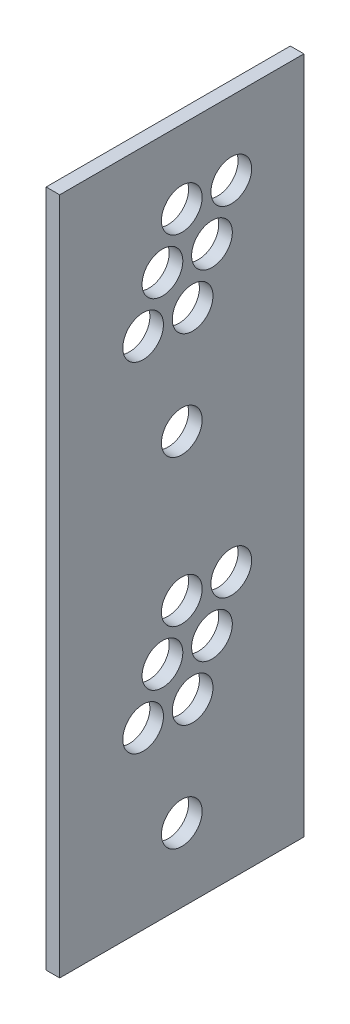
from build123d import *

# Parameters (mm, degrees)
CROQUIS3_W              = 180
CROQUIS3_H              = 500
SALIENTE_EXTRUIR1_DEPTH = 10
CROQUIS5_R              = 15
CORTAR_EXTRUIR2_DEPTH   = 532.507290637
MATRIZL1_COUNT          = 2
MATRIZL1_PITCH          = 250


with BuildPart() as part:
    # Croquis3 → Saliente-Extruir1 (new body)
    with BuildSketch(Plane.ZY.offset(182.695207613)):
        with Locations((-90, 250)):
            Rectangle(CROQUIS3_W, CROQUIS3_H)
    extrude(amount=SALIENTE_EXTRUIR1_DEPTH)

    # Croquis5 → Cortar-Extruir2 (cut, symmetric)
    with BuildSketch(Plane.ZY.offset(192.695207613)):
        with Locations((-90, 54)):
            Circle(CROQUIS5_R)
        with Locations((-98, 129)):
            Circle(CROQUIS5_R)
        with Locations((-112.25, 162.5)):
            Circle(CROQUIS5_R)
        with Locations((-126.5, 196)):
            Circle(CROQUIS5_R)
        with Locations((-75.75, 162.5)):
            Circle(CROQUIS5_R)
        with Locations((-90, 196)):
            Circle(CROQUIS5_R)
        with Locations((-61.5, 129)):
            Circle(CROQUIS5_R)
    cortar_extruir2 = extrude(amount=CORTAR_EXTRUIR2_DEPTH, both=True, mode=Mode.SUBTRACT)

    # MatrizL1: Cortar-Extruir2 ×2
    with Locations(*[(0, i * MATRIZL1_PITCH, 0) for i in range(1, MATRIZL1_COUNT)]):
        add(cortar_extruir2, mode=Mode.SUBTRACT)


solid = part.part
